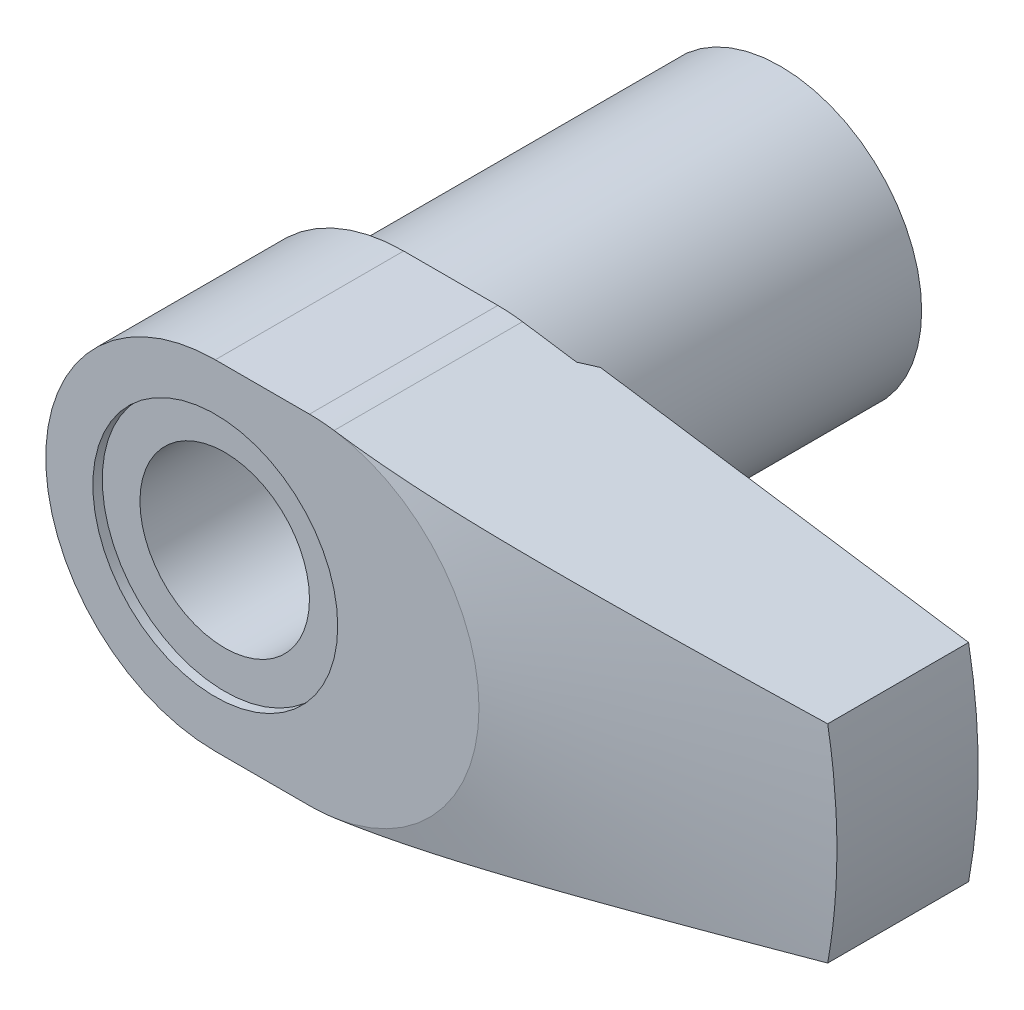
ISO-10303-21;
HEADER;
FILE_DESCRIPTION(('STEP AP214'),'2;1');
FILE_NAME('part.step','',(''),(''),'','','');
FILE_SCHEMA(('AUTOMOTIVE_DESIGN { 1 0 10303 214 1 1 1 1 }'));
ENDSEC;
DATA;
#1=APPLICATION_CONTEXT('core data for automotive mechanical design processes');
#2=APPLICATION_PROTOCOL_DEFINITION('international standard','automotive_design',2000,#1);
#3=PRODUCT_CONTEXT('',#1,'mechanical');
#4=PRODUCT('Part','Part','',(#3));
#5=PRODUCT_RELATED_PRODUCT_CATEGORY('part','',(#4));
#6=PRODUCT_DEFINITION_FORMATION('','',#4);
#7=PRODUCT_DEFINITION_CONTEXT('part definition',#1,'design');
#8=PRODUCT_DEFINITION('design','',#6,#7);
#9=PRODUCT_DEFINITION_SHAPE('','',#8);
#10=(LENGTH_UNIT() NAMED_UNIT(*) SI_UNIT(.MILLI.,.METRE.));
#11=(NAMED_UNIT(*) PLANE_ANGLE_UNIT() SI_UNIT($,.RADIAN.));
#12=(NAMED_UNIT(*) SI_UNIT($,.STERADIAN.) SOLID_ANGLE_UNIT());
#13=UNCERTAINTY_MEASURE_WITH_UNIT(LENGTH_MEASURE(1.E-05),#10,'distance_accuracy_value','');
#14=(GEOMETRIC_REPRESENTATION_CONTEXT(3) GLOBAL_UNCERTAINTY_ASSIGNED_CONTEXT((#13)) GLOBAL_UNIT_ASSIGNED_CONTEXT((#10,
#11,#12)) REPRESENTATION_CONTEXT('',''));
#15=CARTESIAN_POINT('',(0.,0.,0.));
#16=DIRECTION('',(0.,0.,1.));
#17=DIRECTION('',(1.,0.,0.));
#18=AXIS2_PLACEMENT_3D('',#15,#16,#17);
#19=CARTESIAN_POINT('',(58.9830484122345,11.,39.));
#20=DIRECTION('',(0.145289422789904,0.989389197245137,0.));
#21=DIRECTION('',(-0.989389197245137,0.145289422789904,0.));
#22=AXIS2_PLACEMENT_3D('',#19,#20,#21);
#23=PLANE('',#22);
#24=DIRECTION('',(0.,0.,1.));
#25=VECTOR('',#24,1.);
#26=CARTESIAN_POINT('',(12.6152096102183,17.8090055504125,39.));
#27=LINE('',#26,#25);
#28=CARTESIAN_POINT('',(12.6152096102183,17.8090055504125,40.));
#29=VERTEX_POINT('',#28);
#30=CARTESIAN_POINT('',(12.6152096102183,17.8090055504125,60.));
#31=VERTEX_POINT('',#30);
#32=EDGE_CURVE('E117',#29,#31,#27,.T.);
#33=ORIENTED_EDGE('',*,*,#32,.T.);
#34=CARTESIAN_POINT('',(12.6150096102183,17.8090349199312,59.9999999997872));
#35=CARTESIAN_POINT('',(12.9911824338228,17.7537948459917,60.0000106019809));
#36=CARTESIAN_POINT('',(13.367354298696,17.6985549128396,59.99774312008));
#37=CARTESIAN_POINT('',(14.1196416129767,17.5880833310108,59.988723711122));
#38=CARTESIAN_POINT('',(14.4957570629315,17.5328516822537,59.9819718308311));
#39=CARTESIAN_POINT('',(15.2478366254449,17.422410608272,59.9640564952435));
#40=CARTESIAN_POINT('',(15.6238007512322,17.3672011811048,59.9528936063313));
#41=CARTESIAN_POINT('',(16.3755800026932,17.2568042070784,59.9262946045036));
#42=CARTESIAN_POINT('',(16.7513951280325,17.2016166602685,59.9108584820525));
#43=CARTESIAN_POINT('',(17.8778980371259,17.0361924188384,59.8584250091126));
#44=CARTESIAN_POINT('',(18.6283121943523,16.9259959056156,59.8152860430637));
#45=CARTESIAN_POINT('',(20.1281828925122,16.705743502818,59.714381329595));
#46=CARTESIAN_POINT('',(20.877639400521,16.5956876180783,59.6566150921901));
#47=CARTESIAN_POINT('',(22.3744537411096,16.3758840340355,59.5285455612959));
#48=CARTESIAN_POINT('',(23.1218130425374,16.2661361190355,59.4582596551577));
#49=CARTESIAN_POINT('',(24.6154633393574,16.0467971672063,59.3070529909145));
#50=CARTESIAN_POINT('',(25.3617543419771,15.9372061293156,59.2261323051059));
#51=CARTESIAN_POINT('',(26.8535283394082,15.7181427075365,59.0554129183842));
#52=CARTESIAN_POINT('',(27.5990110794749,15.6086703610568,58.9656119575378));
#53=CARTESIAN_POINT('',(29.0890785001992,15.3898575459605,58.7786776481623));
#54=CARTESIAN_POINT('',(29.8336631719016,15.280517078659,58.681544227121));
#55=CARTESIAN_POINT('',(31.7649929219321,14.9969059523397,58.4216406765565));
#56=CARTESIAN_POINT('',(32.951123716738,14.8227254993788,58.2542154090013));
#57=CARTESIAN_POINT('',(35.3217708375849,14.4746016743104,57.9080832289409));
#58=CARTESIAN_POINT('',(36.506287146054,14.3006583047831,57.7293761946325));
#59=CARTESIAN_POINT('',(38.8739700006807,13.952969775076,57.3635505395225));
#60=CARTESIAN_POINT('',(40.0571366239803,13.779224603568,57.1764324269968));
#61=CARTESIAN_POINT('',(42.4224661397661,13.4318816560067,56.7958242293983));
#62=CARTESIAN_POINT('',(43.6046290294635,13.2582838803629,56.6023341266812));
#63=CARTESIAN_POINT('',(45.9707332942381,12.9108271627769,56.210028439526));
#64=CARTESIAN_POINT('',(47.154672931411,12.7369684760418,56.0112021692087));
#65=CARTESIAN_POINT('',(49.5219159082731,12.3893445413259,55.6097077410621));
#66=CARTESIAN_POINT('',(50.7052192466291,12.2155792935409,55.4070395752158));
#67=CARTESIAN_POINT('',(53.0712189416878,11.8681379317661,54.9986842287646));
#68=CARTESIAN_POINT('',(54.2539153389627,11.6944618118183,54.7929972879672));
#69=CARTESIAN_POINT('',(56.6188791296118,11.3471725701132,54.3791585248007));
#70=CARTESIAN_POINT('',(57.8011465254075,11.1735594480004,54.1710067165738));
#71=CARTESIAN_POINT('',(58.9832484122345,10.9999706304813,53.9619061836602));
#72=B_SPLINE_CURVE_WITH_KNOTS('',3,(#34,#35,#36,#37,#38,#39,#40,#41,#42,#43,#44,#45,#46,#47,#48,
#49,#50,#51,#52,#53,#54,#55,#56,#57,#58,#59,#60,#61,#62,#63,#64,#65,#66,#67,#68,#69,#70,#71),
.UNSPECIFIED.,.F.,.F.,(4,2,2,2,2,2,2,2,2,2,2,2,2,2,2,2,2,2,4),(0.,1.14061298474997,
2.28121407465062,3.42166875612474,4.5621259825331,6.84101223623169,9.11997483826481,
11.3957967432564,13.6716031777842,15.9479902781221,18.2243998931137,21.8557763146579,
25.487191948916,29.1183884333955,32.7495949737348,36.3887141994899,40.0278410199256,
43.6666803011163,47.3054987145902),.UNSPECIFIED.);
#73=CARTESIAN_POINT('',(58.9830484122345,11.,53.9619415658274));
#74=VERTEX_POINT('',#73);
#75=EDGE_CURVE('E95',#31,#74,#72,.T.);
#76=ORIENTED_EDGE('',*,*,#75,.T.);
#77=DIRECTION('',(0.,0.,-1.));
#78=VECTOR('',#77,1.);
#79=CARTESIAN_POINT('',(58.9830484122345,11.,60.));
#80=LINE('',#79,#78);
#81=CARTESIAN_POINT('',(58.9830484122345,11.,39.));
#82=VERTEX_POINT('',#81);
#83=EDGE_CURVE('E179',#74,#82,#80,.T.);
#84=ORIENTED_EDGE('',*,*,#83,.T.);
#85=DIRECTION('',(-0.989389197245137,0.145289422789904,0.));
#86=VECTOR('',#85,1.);
#87=CARTESIAN_POINT('',(58.9830484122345,11.,39.));
#88=LINE('',#87,#86);
#89=CARTESIAN_POINT('',(19.8939059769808,16.7401465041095,39.));
#90=VERTEX_POINT('',#89);
#91=EDGE_CURVE('E138',#82,#90,#88,.T.);
#92=ORIENTED_EDGE('',*,*,#91,.T.);
#93=CARTESIAN_POINT('',(18.3623852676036,16.965046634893,40.0002));
#94=CARTESIAN_POINT('',(18.491090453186,16.9461465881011,39.9184911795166));
#95=CARTESIAN_POINT('',(18.6195218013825,16.9272867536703,39.836342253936));
#96=CARTESIAN_POINT('',(18.8758485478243,16.8896457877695,39.6712055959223));
#97=CARTESIAN_POINT('',(19.0037439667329,16.8708646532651,39.5882178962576));
#98=CARTESIAN_POINT('',(19.2590202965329,16.8333779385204,39.4214389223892));
#99=CARTESIAN_POINT('',(19.3864012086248,16.8146723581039,39.3376476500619));
#100=CARTESIAN_POINT('',(19.6406698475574,16.7773336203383,39.1692931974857));
#101=CARTESIAN_POINT('',(19.7675575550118,16.758700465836,39.0847299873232));
#102=CARTESIAN_POINT('',(19.8942042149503,16.7401027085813,38.9998));
#103=B_SPLINE_CURVE_WITH_KNOTS('',3,(#93,#94,#95,#96,#97,#98,#99,#100,#101,#102),.UNSPECIFIED.,
.F.,.F.,(4,2,2,2,4),(0.,0.460853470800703,0.921689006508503,1.3825234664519,1.84337586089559),.UNSPECIFIED.);
#104=CARTESIAN_POINT('',(18.362700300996,16.9650003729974,40.));
#105=VERTEX_POINT('',#104);
#106=EDGE_CURVE('E200',#105,#90,#103,.T.);
#107=ORIENTED_EDGE('',*,*,#106,.F.);
#108=DIRECTION('',(0.989389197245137,-0.145289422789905,0.));
#109=VECTOR('',#108,1.);
#110=CARTESIAN_POINT('',(12.6152096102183,17.8090055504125,40.));
#111=LINE('',#110,#109);
#112=EDGE_CURVE('E119',#29,#105,#111,.T.);
#113=ORIENTED_EDGE('',*,*,#112,.F.);
#114=EDGE_LOOP('',(#33,#76,#84,#92,#107,#113));
#115=FACE_BOUND('',#114,.T.);
#116=ADVANCED_FACE('F15',(#115),#23,.T.);
#117=CARTESIAN_POINT('',(58.9830484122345,-11.,39.));
#118=DIRECTION('',(0.145289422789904,-0.989389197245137,0.));
#119=DIRECTION('',(0.989389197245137,0.145289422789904,0.));
#120=AXIS2_PLACEMENT_3D('',#117,#118,#119);
#121=PLANE('',#120);
#122=DIRECTION('',(0.,0.,-1.));
#123=VECTOR('',#122,1.);
#124=CARTESIAN_POINT('',(58.9830484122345,-11.,60.));
#125=LINE('',#124,#123);
#126=CARTESIAN_POINT('',(58.9830484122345,-11.,53.9619415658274));
#127=VERTEX_POINT('',#126);
#128=CARTESIAN_POINT('',(58.9830484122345,-11.,39.));
#129=VERTEX_POINT('',#128);
#130=EDGE_CURVE('E177',#127,#129,#125,.T.);
#131=ORIENTED_EDGE('',*,*,#130,.F.);
#132=CARTESIAN_POINT('',(58.9832484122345,-10.9999706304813,53.9619061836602));
#133=CARTESIAN_POINT('',(58.0231922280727,-11.1409525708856,54.1317398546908));
#134=CARTESIAN_POINT('',(57.0630250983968,-11.2819508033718,54.3009356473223));
#135=CARTESIAN_POINT('',(55.142421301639,-11.5639868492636,54.6377671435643));
#136=CARTESIAN_POINT('',(54.1819846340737,-11.7050246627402,54.8054028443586));
#137=CARTESIAN_POINT('',(52.260914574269,-11.9871291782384,55.1388089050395));
#138=CARTESIAN_POINT('',(51.3002812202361,-12.1281958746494,55.3045794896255));
#139=CARTESIAN_POINT('',(49.3786418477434,-12.4103839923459,55.6338994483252));
#140=CARTESIAN_POINT('',(48.4176358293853,-12.5515054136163,55.7974488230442));
#141=CARTESIAN_POINT('',(46.496445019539,-12.8336276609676,56.1216395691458));
#142=CARTESIAN_POINT('',(45.5362608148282,-12.9746284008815,56.2822844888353));
#143=CARTESIAN_POINT('',(43.6153590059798,-13.2567082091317,56.6002814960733));
#144=CARTESIAN_POINT('',(42.6546414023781,-13.3977872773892,56.7576335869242));
#145=CARTESIAN_POINT('',(40.732411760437,-13.6800620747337,57.0682858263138));
#146=CARTESIAN_POINT('',(39.7708996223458,-13.8212578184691,57.2215853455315));
#147=CARTESIAN_POINT('',(37.8470892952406,-14.1037647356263,57.5230844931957));
#148=CARTESIAN_POINT('',(36.8847911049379,-14.2450759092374,57.6712841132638));
#149=CARTESIAN_POINT('',(34.9572801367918,-14.5281262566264,57.9615350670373));
#150=CARTESIAN_POINT('',(33.9920654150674,-14.6698657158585,58.103573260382));
#151=CARTESIAN_POINT('',(32.0604798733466,-14.9535144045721,58.3793993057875));
#152=CARTESIAN_POINT('',(31.0941090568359,-15.0954236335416,58.5131871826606));
#153=CARTESIAN_POINT('',(29.1603307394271,-15.3793943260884,58.7701339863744));
#154=CARTESIAN_POINT('',(28.192923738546,-15.5214557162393,58.8932967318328));
#155=CARTESIAN_POINT('',(26.2564755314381,-15.8058184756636,59.1260476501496));
#156=CARTESIAN_POINT('',(25.2874342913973,-15.9481198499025,59.2356355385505));
#157=CARTESIAN_POINT('',(23.3460886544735,-16.2332017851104,59.4376703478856));
#158=CARTESIAN_POINT('',(22.3737815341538,-16.3759827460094,59.5300908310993));
#159=CARTESIAN_POINT('',(20.427420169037,-16.6618012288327,59.6932612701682));
#160=CARTESIAN_POINT('',(19.4533660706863,-16.8048387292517,59.7640129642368));
#161=CARTESIAN_POINT('',(17.9905574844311,-17.0196486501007,59.8507099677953));
#162=CARTESIAN_POINT('',(17.5023589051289,-17.0913394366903,59.8763805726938));
#163=CARTESIAN_POINT('',(16.5256514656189,-17.2347665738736,59.9207648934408));
#164=CARTESIAN_POINT('',(16.0371426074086,-17.3065029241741,59.939478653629));
#165=CARTESIAN_POINT('',(15.0597610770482,-17.4500290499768,59.9695772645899));
#166=CARTESIAN_POINT('',(14.5708883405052,-17.5218188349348,59.9809599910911));
#167=CARTESIAN_POINT('',(13.5930146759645,-17.6654172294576,59.9961857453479));
#168=CARTESIAN_POINT('',(13.1040137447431,-17.7372258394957,60.0000285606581));
#169=CARTESIAN_POINT('',(12.6150096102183,-17.8090349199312,59.9999999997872));
#170=B_SPLINE_CURVE_WITH_KNOTS('',3,(#132,#133,#134,#135,#136,#137,#138,#139,#140,#141,#142,
#143,#144,#145,#146,#147,#148,#149,#150,#151,#152,#153,#154,#155,#156,#157,#158,#159,#160,#161,
#162,#163,#164,#165,#166,#167,#168,#169),.UNSPECIFIED.,.F.,.F.,(4,2,2,2,2,2,2,2,2,2,2,2,2,2,2,2,
2,2,4),(0.,2.95530850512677,5.9106223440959,8.86557624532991,11.8205293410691,14.771588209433,
17.7226441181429,20.6741556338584,23.6256719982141,26.5832011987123,29.5407215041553,
32.4971744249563,35.4536892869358,38.4147200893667,41.3755133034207,42.8577769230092,
44.340031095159,45.8227145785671,47.3054398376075),.UNSPECIFIED.);
#171=CARTESIAN_POINT('',(12.6152096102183,-17.8090055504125,60.));
#172=VERTEX_POINT('',#171);
#173=EDGE_CURVE('E34',#127,#172,#170,.T.);
#174=ORIENTED_EDGE('',*,*,#173,.T.);
#175=DIRECTION('',(0.,0.,1.));
#176=VECTOR('',#175,1.);
#177=CARTESIAN_POINT('',(12.6152096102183,-17.8090055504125,39.));
#178=LINE('',#177,#176);
#179=CARTESIAN_POINT('',(12.6152096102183,-17.8090055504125,40.));
#180=VERTEX_POINT('',#179);
#181=EDGE_CURVE('E123',#180,#172,#178,.T.);
#182=ORIENTED_EDGE('',*,*,#181,.F.);
#183=DIRECTION('',(-0.989389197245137,-0.145289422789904,0.));
#184=VECTOR('',#183,1.);
#185=CARTESIAN_POINT('',(18.362700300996,-16.9650003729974,40.));
#186=LINE('',#185,#184);
#187=CARTESIAN_POINT('',(18.362700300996,-16.9650003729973,40.));
#188=VERTEX_POINT('',#187);
#189=EDGE_CURVE('E224',#188,#180,#186,.T.);
#190=ORIENTED_EDGE('',*,*,#189,.F.);
#191=CARTESIAN_POINT('',(19.8942042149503,-16.7401027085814,38.9998));
#192=CARTESIAN_POINT('',(19.7675575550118,-16.758700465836,39.0847299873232));
#193=CARTESIAN_POINT('',(19.6406698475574,-16.7773336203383,39.1692931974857));
#194=CARTESIAN_POINT('',(19.3864012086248,-16.8146723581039,39.3376476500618));
#195=CARTESIAN_POINT('',(19.2590202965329,-16.8333779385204,39.4214389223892));
#196=CARTESIAN_POINT('',(19.0037439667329,-16.8708646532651,39.5882178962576));
#197=CARTESIAN_POINT('',(18.8758485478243,-16.8896457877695,39.6712055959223));
#198=CARTESIAN_POINT('',(18.6195218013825,-16.9272867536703,39.836342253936));
#199=CARTESIAN_POINT('',(18.491090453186,-16.9461465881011,39.9184911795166));
#200=CARTESIAN_POINT('',(18.3623852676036,-16.965046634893,40.0002));
#201=B_SPLINE_CURVE_WITH_KNOTS('',3,(#191,#192,#193,#194,#195,#196,#197,#198,#199,#200),
.UNSPECIFIED.,.F.,.F.,(4,2,2,2,4),(0.,0.46085239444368,0.921686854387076,1.38252239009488,
1.84337586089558),.UNSPECIFIED.);
#202=CARTESIAN_POINT('',(19.8939059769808,-16.7401465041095,39.));
#203=VERTEX_POINT('',#202);
#204=EDGE_CURVE('E28',#203,#188,#201,.T.);
#205=ORIENTED_EDGE('',*,*,#204,.F.);
#206=DIRECTION('',(0.989389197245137,0.145289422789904,0.));
#207=VECTOR('',#206,1.);
#208=CARTESIAN_POINT('',(58.9830484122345,-11.,39.));
#209=LINE('',#208,#207);
#210=EDGE_CURVE('E142',#203,#129,#209,.T.);
#211=ORIENTED_EDGE('',*,*,#210,.T.);
#212=EDGE_LOOP('',(#131,#174,#182,#190,#205,#211));
#213=FACE_BOUND('',#212,.T.);
#214=ADVANCED_FACE('F188',(#213),#121,.T.);
#215=CARTESIAN_POINT('',(0.,0.,60.));
#216=DIRECTION('',(0.,0.,1.));
#217=DIRECTION('',(1.,0.,0.));
#218=AXIS2_PLACEMENT_3D('',#215,#216,#217);
#219=PLANE('',#218);
#220=CARTESIAN_POINT('',(0.,0.,60.));
#221=DIRECTION('',(0.,0.,1.));
#222=DIRECTION('',(1.,0.,0.));
#223=AXIS2_PLACEMENT_3D('',#220,#221,#222);
#224=CIRCLE('',#223,13.);
#225=CARTESIAN_POINT('',(13.,0.,60.));
#226=VERTEX_POINT('',#225);
#227=EDGE_CURVE('E122',#226,#226,#224,.T.);
#228=ORIENTED_EDGE('',*,*,#227,.F.);
#229=EDGE_LOOP('',(#228));
#230=FACE_BOUND('',#229,.T.);
#231=CARTESIAN_POINT('',(10.,0.,60.));
#232=DIRECTION('',(0.,0.,1.));
#233=DIRECTION('',(1.,0.,0.));
#234=AXIS2_PLACEMENT_3D('',#231,#232,#233);
#235=CIRCLE('',#234,18.);
#236=CARTESIAN_POINT('',(10.,-18.,60.));
#237=VERTEX_POINT('',#236);
#238=EDGE_CURVE('E113',#237,#172,#235,.T.);
#239=ORIENTED_EDGE('',*,*,#238,.T.);
#240=CARTESIAN_POINT('',(10.,0.,60.));
#241=DIRECTION('',(0.,0.,-1.));
#242=DIRECTION('',(-1.,0.,0.));
#243=AXIS2_PLACEMENT_3D('',#240,#241,#242);
#244=CIRCLE('',#243,18.);
#245=EDGE_CURVE('E98',#31,#172,#244,.T.);
#246=ORIENTED_EDGE('',*,*,#245,.F.);
#247=CARTESIAN_POINT('',(10.,0.,60.));
#248=DIRECTION('',(0.,0.,1.));
#249=DIRECTION('',(1.,0.,0.));
#250=AXIS2_PLACEMENT_3D('',#247,#248,#249);
#251=CIRCLE('',#250,18.);
#252=CARTESIAN_POINT('',(10.,18.,60.));
#253=VERTEX_POINT('',#252);
#254=EDGE_CURVE('E110',#31,#253,#251,.T.);
#255=ORIENTED_EDGE('',*,*,#254,.T.);
#256=DIRECTION('',(-1.,0.,0.));
#257=VECTOR('',#256,1.);
#258=CARTESIAN_POINT('',(10.,18.,60.));
#259=LINE('',#258,#257);
#260=CARTESIAN_POINT('',(0.,18.,60.));
#261=VERTEX_POINT('',#260);
#262=EDGE_CURVE('E129',#253,#261,#259,.T.);
#263=ORIENTED_EDGE('',*,*,#262,.T.);
#264=CARTESIAN_POINT('',(0.,0.,60.));
#265=DIRECTION('',(0.,0.,1.));
#266=DIRECTION('',(1.,0.,0.));
#267=AXIS2_PLACEMENT_3D('',#264,#265,#266);
#268=CIRCLE('',#267,18.);
#269=CARTESIAN_POINT('',(1.88540101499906E-13,-18.,60.));
#270=VERTEX_POINT('',#269);
#271=EDGE_CURVE('E174',#261,#270,#268,.T.);
#272=ORIENTED_EDGE('',*,*,#271,.T.);
#273=DIRECTION('',(1.,0.,0.));
#274=VECTOR('',#273,1.);
#275=CARTESIAN_POINT('',(1.88540101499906E-13,-18.,60.));
#276=LINE('',#275,#274);
#277=EDGE_CURVE('E132',#270,#237,#276,.T.);
#278=ORIENTED_EDGE('',*,*,#277,.T.);
#279=EDGE_LOOP('',(#239,#246,#255,#263,#272,#278));
#280=FACE_BOUND('',#279,.T.);
#281=ADVANCED_FACE('F107',(#230,#280),#219,.T.);
#282=CARTESIAN_POINT('',(0.,0.,60.));
#283=DIRECTION('',(0.,0.,-1.));
#284=DIRECTION('',(-1.,0.,0.));
#285=AXIS2_PLACEMENT_3D('',#282,#283,#284);
#286=CYLINDRICAL_SURFACE('',#285,60.);
#287=CARTESIAN_POINT('',(58.9830111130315,-11.0002,53.9619401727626));
#288=CARTESIAN_POINT('',(59.1527592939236,-10.0901020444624,53.9682804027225));
#289=CARTESIAN_POINT('',(59.3014121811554,-9.17606456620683,53.9738383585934));
#290=CARTESIAN_POINT('',(59.5562782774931,-7.34208965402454,53.9833738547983));
#291=CARTESIAN_POINT('',(59.6624917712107,-6.42215225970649,53.9873514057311));
#292=CARTESIAN_POINT('',(59.8315166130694,-4.58611821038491,53.9936834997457));
#293=CARTESIAN_POINT('',(59.8946863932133,-3.67005458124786,53.9960514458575));
#294=CARTESIAN_POINT('',(59.9789280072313,-1.8359939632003,53.9992096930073));
#295=CARTESIAN_POINT('',(60.,-0.91799698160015,54.));
#296=CARTESIAN_POINT('',(60.,0.91799698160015,54.));
#297=CARTESIAN_POINT('',(59.9789280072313,1.8359939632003,53.9992096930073));
#298=CARTESIAN_POINT('',(59.8946863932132,3.67005458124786,53.9960514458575));
#299=CARTESIAN_POINT('',(59.8315166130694,4.58611821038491,53.9936834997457));
#300=CARTESIAN_POINT('',(59.6624917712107,6.42215225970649,53.9873514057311));
#301=CARTESIAN_POINT('',(59.5562782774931,7.34208965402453,53.9833738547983));
#302=CARTESIAN_POINT('',(59.3014121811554,9.17606456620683,53.9738383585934));
#303=CARTESIAN_POINT('',(59.1527592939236,10.0901020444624,53.9682804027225));
#304=CARTESIAN_POINT('',(58.9830111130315,11.0002,53.9619401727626));
#305=B_SPLINE_CURVE_WITH_KNOTS('',3,(#287,#288,#289,#290,#291,#292,#293,#294,#295,#296,#297,
#298,#299,#300,#301,#302,#303,#304),.UNSPECIFIED.,.F.,.F.,(4,2,2,2,2,2,2,2,4),(0.,
2.77719602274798,5.55437342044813,8.30813254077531,11.0618812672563,13.8156299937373,
16.5693891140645,19.3465665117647,22.1237625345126),.UNSPECIFIED.);
#306=EDGE_CURVE('E9',#127,#74,#305,.T.);
#307=ORIENTED_EDGE('',*,*,#306,.F.);
#308=ORIENTED_EDGE('',*,*,#130,.T.);
#309=CARTESIAN_POINT('',(0.,0.,39.));
#310=DIRECTION('',(0.,0.,1.));
#311=DIRECTION('',(1.,0.,0.));
#312=AXIS2_PLACEMENT_3D('',#309,#310,#311);
#313=CIRCLE('',#312,60.);
#314=EDGE_CURVE('E171',#129,#82,#313,.T.);
#315=ORIENTED_EDGE('',*,*,#314,.T.);
#316=ORIENTED_EDGE('',*,*,#83,.F.);
#317=EDGE_LOOP('',(#307,#308,#315,#316));
#318=FACE_BOUND('',#317,.T.);
#319=ADVANCED_FACE('F244',(#318),#286,.T.);
#320=CARTESIAN_POINT('',(10.,0.,39.));
#321=DIRECTION('',(0.,0.,1.));
#322=DIRECTION('',(1.,0.,0.));
#323=AXIS2_PLACEMENT_3D('',#320,#321,#322);
#324=CYLINDRICAL_SURFACE('',#323,18.);
#325=ORIENTED_EDGE('',*,*,#32,.F.);
#326=CARTESIAN_POINT('',(10.,0.,40.));
#327=DIRECTION('',(0.,0.,-1.));
#328=DIRECTION('',(-1.,0.,0.));
#329=AXIS2_PLACEMENT_3D('',#326,#327,#328);
#330=CIRCLE('',#329,18.);
#331=CARTESIAN_POINT('',(10.,18.,40.));
#332=VERTEX_POINT('',#331);
#333=EDGE_CURVE('E102',#332,#29,#330,.T.);
#334=ORIENTED_EDGE('',*,*,#333,.F.);
#335=DIRECTION('',(0.,0.,1.));
#336=VECTOR('',#335,1.);
#337=CARTESIAN_POINT('',(10.,18.,39.));
#338=LINE('',#337,#336);
#339=EDGE_CURVE('E127',#332,#253,#338,.T.);
#340=ORIENTED_EDGE('',*,*,#339,.T.);
#341=ORIENTED_EDGE('',*,*,#254,.F.);
#342=EDGE_LOOP('',(#325,#334,#340,#341));
#343=FACE_BOUND('',#342,.T.);
#344=ADVANCED_FACE('F125',(#343),#324,.T.);
#345=CARTESIAN_POINT('',(10.,0.,39.));
#346=DIRECTION('',(0.,0.,1.));
#347=DIRECTION('',(1.,0.,0.));
#348=AXIS2_PLACEMENT_3D('',#345,#346,#347);
#349=CYLINDRICAL_SURFACE('',#348,18.);
#350=DIRECTION('',(0.,0.,1.));
#351=VECTOR('',#350,1.);
#352=CARTESIAN_POINT('',(10.,-18.,39.));
#353=LINE('',#352,#351);
#354=CARTESIAN_POINT('',(10.,-18.,40.));
#355=VERTEX_POINT('',#354);
#356=EDGE_CURVE('E146',#355,#237,#353,.T.);
#357=ORIENTED_EDGE('',*,*,#356,.F.);
#358=CARTESIAN_POINT('',(10.,0.,40.));
#359=DIRECTION('',(0.,0.,-1.));
#360=DIRECTION('',(-1.,0.,0.));
#361=AXIS2_PLACEMENT_3D('',#358,#359,#360);
#362=CIRCLE('',#361,18.);
#363=EDGE_CURVE('E226',#180,#355,#362,.T.);
#364=ORIENTED_EDGE('',*,*,#363,.F.);
#365=ORIENTED_EDGE('',*,*,#181,.T.);
#366=ORIENTED_EDGE('',*,*,#238,.F.);
#367=EDGE_LOOP('',(#357,#364,#365,#366));
#368=FACE_BOUND('',#367,.T.);
#369=ADVANCED_FACE('F252',(#368),#349,.T.);
#370=CARTESIAN_POINT('',(1.88540101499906E-13,-18.,39.));
#371=DIRECTION('',(0.,-1.,0.));
#372=DIRECTION('',(1.,0.,0.));
#373=AXIS2_PLACEMENT_3D('',#370,#371,#372);
#374=PLANE('',#373);
#375=DIRECTION('',(0.,0.,1.));
#376=VECTOR('',#375,1.);
#377=CARTESIAN_POINT('',(1.88540101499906E-13,-18.,39.));
#378=LINE('',#377,#376);
#379=CARTESIAN_POINT('',(0.,-18.,40.));
#380=VERTEX_POINT('',#379);
#381=EDGE_CURVE('E148',#380,#270,#378,.T.);
#382=ORIENTED_EDGE('',*,*,#381,.F.);
#383=DIRECTION('',(-1.,0.,0.));
#384=VECTOR('',#383,1.);
#385=CARTESIAN_POINT('',(10.,-18.,40.));
#386=LINE('',#385,#384);
#387=EDGE_CURVE('E228',#355,#380,#386,.T.);
#388=ORIENTED_EDGE('',*,*,#387,.F.);
#389=ORIENTED_EDGE('',*,*,#356,.T.);
#390=ORIENTED_EDGE('',*,*,#277,.F.);
#391=EDGE_LOOP('',(#382,#388,#389,#390));
#392=FACE_BOUND('',#391,.T.);
#393=ADVANCED_FACE('F291',(#392),#374,.T.);
#394=CARTESIAN_POINT('',(10.,18.,39.));
#395=DIRECTION('',(0.,1.,0.));
#396=DIRECTION('',(-1.,0.,0.));
#397=AXIS2_PLACEMENT_3D('',#394,#395,#396);
#398=PLANE('',#397);
#399=ORIENTED_EDGE('',*,*,#339,.F.);
#400=DIRECTION('',(1.,0.,0.));
#401=VECTOR('',#400,1.);
#402=CARTESIAN_POINT('',(0.,18.,40.));
#403=LINE('',#402,#401);
#404=CARTESIAN_POINT('',(0.,18.,40.));
#405=VERTEX_POINT('',#404);
#406=EDGE_CURVE('E230',#405,#332,#403,.T.);
#407=ORIENTED_EDGE('',*,*,#406,.F.);
#408=DIRECTION('',(0.,0.,1.));
#409=VECTOR('',#408,1.);
#410=CARTESIAN_POINT('',(0.,18.,39.));
#411=LINE('',#410,#409);
#412=EDGE_CURVE('E150',#405,#261,#411,.T.);
#413=ORIENTED_EDGE('',*,*,#412,.T.);
#414=ORIENTED_EDGE('',*,*,#262,.F.);
#415=EDGE_LOOP('',(#399,#407,#413,#414));
#416=FACE_BOUND('',#415,.T.);
#417=ADVANCED_FACE('F288',(#416),#398,.T.);
#418=CARTESIAN_POINT('',(0.,0.,60.));
#419=DIRECTION('',(0.,0.,-1.));
#420=DIRECTION('',(-1.,0.,0.));
#421=AXIS2_PLACEMENT_3D('',#418,#419,#420);
#422=CYLINDRICAL_SURFACE('',#421,18.);
#423=CARTESIAN_POINT('',(0.,0.,40.));
#424=DIRECTION('',(0.,0.,1.));
#425=DIRECTION('',(1.,0.,0.));
#426=AXIS2_PLACEMENT_3D('',#423,#424,#425);
#427=CIRCLE('',#426,18.);
#428=EDGE_CURVE('E135',#405,#380,#427,.T.);
#429=ORIENTED_EDGE('',*,*,#428,.T.);
#430=ORIENTED_EDGE('',*,*,#381,.T.);
#431=ORIENTED_EDGE('',*,*,#271,.F.);
#432=ORIENTED_EDGE('',*,*,#412,.F.);
#433=EDGE_LOOP('',(#429,#430,#431,#432));
#434=FACE_BOUND('',#433,.T.);
#435=ADVANCED_FACE('F17',(#434),#422,.T.);
#436=CARTESIAN_POINT('',(70.,20.,39.));
#437=DIRECTION('',(0.,0.,1.));
#438=DIRECTION('',(1.,0.,0.));
#439=AXIS2_PLACEMENT_3D('',#436,#437,#438);
#440=PLANE('',#439);
#441=ORIENTED_EDGE('',*,*,#210,.F.);
#442=CARTESIAN_POINT('',(0.,0.,39.));
#443=DIRECTION('',(0.,0.,1.));
#444=DIRECTION('',(1.,0.,0.));
#445=AXIS2_PLACEMENT_3D('',#442,#443,#444);
#446=CIRCLE('',#445,26.);
#447=EDGE_CURVE('E42',#203,#90,#446,.T.);
#448=ORIENTED_EDGE('',*,*,#447,.T.);
#449=ORIENTED_EDGE('',*,*,#91,.F.);
#450=ORIENTED_EDGE('',*,*,#314,.F.);
#451=EDGE_LOOP('',(#441,#448,#449,#450));
#452=FACE_BOUND('',#451,.T.);
#453=ADVANCED_FACE('F242',(#452),#440,.F.);
#454=CARTESIAN_POINT('',(0.,0.,0.));
#455=DIRECTION('',(0.,0.,-1.));
#456=DIRECTION('',(-1.,0.,0.));
#457=AXIS2_PLACEMENT_3D('',#454,#455,#456);
#458=CYLINDRICAL_SURFACE('',#457,9.);
#459=CARTESIAN_POINT('',(0.,0.,34.));
#460=DIRECTION('',(0.,0.,-1.));
#461=DIRECTION('',(-1.,0.,0.));
#462=AXIS2_PLACEMENT_3D('',#459,#460,#461);
#463=CIRCLE('',#462,9.);
#464=CARTESIAN_POINT('',(-9.,0.,34.));
#465=VERTEX_POINT('',#464);
#466=EDGE_CURVE('E165',#465,#465,#463,.T.);
#467=ORIENTED_EDGE('',*,*,#466,.T.);
#468=EDGE_LOOP('',(#467));
#469=FACE_BOUND('',#468,.T.);
#470=CARTESIAN_POINT('',(0.,0.,59.));
#471=DIRECTION('',(0.,0.,1.));
#472=DIRECTION('',(1.,0.,0.));
#473=AXIS2_PLACEMENT_3D('',#470,#471,#472);
#474=CIRCLE('',#473,9.);
#475=CARTESIAN_POINT('',(9.,0.,59.));
#476=VERTEX_POINT('',#475);
#477=EDGE_CURVE('E156',#476,#476,#474,.T.);
#478=ORIENTED_EDGE('',*,*,#477,.T.);
#479=EDGE_LOOP('',(#478));
#480=FACE_BOUND('',#479,.T.);
#481=ADVANCED_FACE('F262',(#469,#480),#458,.F.);
#482=CARTESIAN_POINT('',(0.,0.,0.));
#483=DIRECTION('',(0.,0.,1.));
#484=DIRECTION('',(1.,0.,0.));
#485=AXIS2_PLACEMENT_3D('',#482,#483,#484);
#486=PLANE('',#485);
#487=CARTESIAN_POINT('',(0.,0.,0.));
#488=DIRECTION('',(0.,0.,-1.));
#489=DIRECTION('',(-1.,0.,0.));
#490=AXIS2_PLACEMENT_3D('',#487,#488,#489);
#491=CIRCLE('',#490,15.);
#492=CARTESIAN_POINT('',(-15.,0.,0.));
#493=VERTEX_POINT('',#492);
#494=EDGE_CURVE('E168',#493,#493,#491,.T.);
#495=ORIENTED_EDGE('',*,*,#494,.T.);
#496=EDGE_LOOP('',(#495));
#497=FACE_BOUND('',#496,.T.);
#498=CARTESIAN_POINT('',(0.,0.,0.));
#499=DIRECTION('',(0.,0.,-1.));
#500=DIRECTION('',(-1.,0.,0.));
#501=AXIS2_PLACEMENT_3D('',#498,#499,#500);
#502=CIRCLE('',#501,11.5);
#503=CARTESIAN_POINT('',(-11.5,0.,0.));
#504=VERTEX_POINT('',#503);
#505=EDGE_CURVE('E159',#504,#504,#502,.T.);
#506=ORIENTED_EDGE('',*,*,#505,.F.);
#507=EDGE_LOOP('',(#506));
#508=FACE_BOUND('',#507,.T.);
#509=ADVANCED_FACE('F258',(#497,#508),#486,.F.);
#510=CARTESIAN_POINT('',(0.,0.,39.));
#511=DIRECTION('',(0.,0.,-1.));
#512=DIRECTION('',(-1.,0.,0.));
#513=AXIS2_PLACEMENT_3D('',#510,#511,#512);
#514=CYLINDRICAL_SURFACE('',#513,15.);
#515=ORIENTED_EDGE('',*,*,#494,.F.);
#516=EDGE_LOOP('',(#515));
#517=FACE_BOUND('',#516,.T.);
#518=CARTESIAN_POINT('',(0.,0.,40.));
#519=DIRECTION('',(0.,0.,1.));
#520=DIRECTION('',(1.,0.,0.));
#521=AXIS2_PLACEMENT_3D('',#518,#519,#520);
#522=CIRCLE('',#521,15.);
#523=CARTESIAN_POINT('',(15.,0.,40.));
#524=VERTEX_POINT('',#523);
#525=EDGE_CURVE('E130',#524,#524,#522,.T.);
#526=ORIENTED_EDGE('',*,*,#525,.F.);
#527=EDGE_LOOP('',(#526));
#528=FACE_BOUND('',#527,.T.);
#529=ADVANCED_FACE('F261',(#517,#528),#514,.T.);
#530=CARTESIAN_POINT('',(9.,0.,34.));
#531=DIRECTION('',(0.,0.,-1.));
#532=DIRECTION('',(-1.,0.,0.));
#533=AXIS2_PLACEMENT_3D('',#530,#531,#532);
#534=PLANE('',#533);
#535=CARTESIAN_POINT('',(0.,0.,34.));
#536=DIRECTION('',(0.,0.,-1.));
#537=DIRECTION('',(-1.,0.,0.));
#538=AXIS2_PLACEMENT_3D('',#535,#536,#537);
#539=CIRCLE('',#538,11.5);
#540=CARTESIAN_POINT('',(-11.5,0.,34.));
#541=VERTEX_POINT('',#540);
#542=EDGE_CURVE('E162',#541,#541,#539,.T.);
#543=ORIENTED_EDGE('',*,*,#542,.T.);
#544=EDGE_LOOP('',(#543));
#545=FACE_BOUND('',#544,.T.);
#546=ORIENTED_EDGE('',*,*,#466,.F.);
#547=EDGE_LOOP('',(#546));
#548=FACE_BOUND('',#547,.T.);
#549=ADVANCED_FACE('F268',(#545,#548),#534,.T.);
#550=CARTESIAN_POINT('',(0.,0.,0.));
#551=DIRECTION('',(0.,0.,-1.));
#552=DIRECTION('',(-1.,0.,0.));
#553=AXIS2_PLACEMENT_3D('',#550,#551,#552);
#554=CYLINDRICAL_SURFACE('',#553,11.5);
#555=ORIENTED_EDGE('',*,*,#505,.T.);
#556=EDGE_LOOP('',(#555));
#557=FACE_BOUND('',#556,.T.);
#558=ORIENTED_EDGE('',*,*,#542,.F.);
#559=EDGE_LOOP('',(#558));
#560=FACE_BOUND('',#559,.T.);
#561=ADVANCED_FACE('F275',(#557,#560),#554,.F.);
#562=CARTESIAN_POINT('',(0.,0.,59.));
#563=DIRECTION('',(0.,0.,1.));
#564=DIRECTION('',(1.,0.,0.));
#565=AXIS2_PLACEMENT_3D('',#562,#563,#564);
#566=CYLINDRICAL_SURFACE('',#565,13.);
#567=CARTESIAN_POINT('',(0.,0.,59.));
#568=DIRECTION('',(0.,0.,1.));
#569=DIRECTION('',(1.,0.,0.));
#570=AXIS2_PLACEMENT_3D('',#567,#568,#569);
#571=CIRCLE('',#570,13.);
#572=CARTESIAN_POINT('',(13.,0.,59.));
#573=VERTEX_POINT('',#572);
#574=EDGE_CURVE('E153',#573,#573,#571,.T.);
#575=ORIENTED_EDGE('',*,*,#574,.F.);
#576=EDGE_LOOP('',(#575));
#577=FACE_BOUND('',#576,.T.);
#578=ORIENTED_EDGE('',*,*,#227,.T.);
#579=EDGE_LOOP('',(#578));
#580=FACE_BOUND('',#579,.T.);
#581=ADVANCED_FACE('F279',(#577,#580),#566,.F.);
#582=CARTESIAN_POINT('',(0.,0.,59.));
#583=DIRECTION('',(0.,0.,1.));
#584=DIRECTION('',(1.,0.,0.));
#585=AXIS2_PLACEMENT_3D('',#582,#583,#584);
#586=PLANE('',#585);
#587=ORIENTED_EDGE('',*,*,#477,.F.);
#588=EDGE_LOOP('',(#587));
#589=FACE_BOUND('',#588,.T.);
#590=ORIENTED_EDGE('',*,*,#574,.T.);
#591=EDGE_LOOP('',(#590));
#592=FACE_BOUND('',#591,.T.);
#593=ADVANCED_FACE('F283',(#589,#592),#586,.T.);
#594=CARTESIAN_POINT('',(-15.,0.,40.));
#595=DIRECTION('',(0.,0.,-1.));
#596=DIRECTION('',(-1.,0.,0.));
#597=AXIS2_PLACEMENT_3D('',#594,#595,#596);
#598=PLANE('',#597);
#599=ORIENTED_EDGE('',*,*,#525,.T.);
#600=EDGE_LOOP('',(#599));
#601=FACE_BOUND('',#600,.T.);
#602=ORIENTED_EDGE('',*,*,#428,.F.);
#603=ORIENTED_EDGE('',*,*,#406,.T.);
#604=ORIENTED_EDGE('',*,*,#333,.T.);
#605=ORIENTED_EDGE('',*,*,#112,.T.);
#606=CARTESIAN_POINT('',(0.,0.,40.));
#607=DIRECTION('',(0.,0.,1.));
#608=DIRECTION('',(1.,0.,0.));
#609=AXIS2_PLACEMENT_3D('',#606,#607,#608);
#610=CIRCLE('',#609,25.);
#611=EDGE_CURVE('E207',#188,#105,#610,.T.);
#612=ORIENTED_EDGE('',*,*,#611,.F.);
#613=ORIENTED_EDGE('',*,*,#189,.T.);
#614=ORIENTED_EDGE('',*,*,#363,.T.);
#615=ORIENTED_EDGE('',*,*,#387,.T.);
#616=EDGE_LOOP('',(#602,#603,#604,#605,#612,#613,#614,#615));
#617=FACE_BOUND('',#616,.T.);
#618=ADVANCED_FACE('F196',(#601,#617),#598,.T.);
#619=CARTESIAN_POINT('',(0.,0.,40.));
#620=DIRECTION('',(0.,0.,-1.));
#621=DIRECTION('',(-1.,0.,0.));
#622=AXIS2_PLACEMENT_3D('',#619,#620,#621);
#623=CONICAL_SURFACE('',#622,25.,0.785398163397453);
#624=ORIENTED_EDGE('',*,*,#106,.T.);
#625=ORIENTED_EDGE('',*,*,#447,.F.);
#626=ORIENTED_EDGE('',*,*,#204,.T.);
#627=ORIENTED_EDGE('',*,*,#611,.T.);
#628=EDGE_LOOP('',(#624,#625,#626,#627));
#629=FACE_BOUND('',#628,.T.);
#630=ADVANCED_FACE('F192',(#629),#623,.F.);
#631=CARTESIAN_POINT('',(10.,0.,51.7482033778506));
#632=DIRECTION('',(0.,0.,-1.));
#633=DIRECTION('',(-1.,0.,0.));
#634=AXIS2_PLACEMENT_3D('',#631,#632,#633);
#635=CONICAL_SURFACE('',#634,62.0095819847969,1.3854483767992);
#636=ORIENTED_EDGE('',*,*,#245,.T.);
#637=ORIENTED_EDGE('',*,*,#173,.F.);
#638=ORIENTED_EDGE('',*,*,#306,.T.);
#639=ORIENTED_EDGE('',*,*,#75,.F.);
#640=EDGE_LOOP('',(#636,#637,#638,#639));
#641=FACE_BOUND('',#640,.T.);
#642=ADVANCED_FACE('F97',(#641),#635,.T.);
#643=CLOSED_SHELL('',(#116,#214,#281,#319,#344,#369,#393,#417,#435,#453,#481,#509,#529,#549,
#561,#581,#593,#618,#630,#642));
#644=MANIFOLD_SOLID_BREP('B1',#643);
#645=ADVANCED_BREP_SHAPE_REPRESENTATION('',(#18,#644),#14);
#646=SHAPE_DEFINITION_REPRESENTATION(#9,#645);
ENDSEC;
END-ISO-10303-21;
